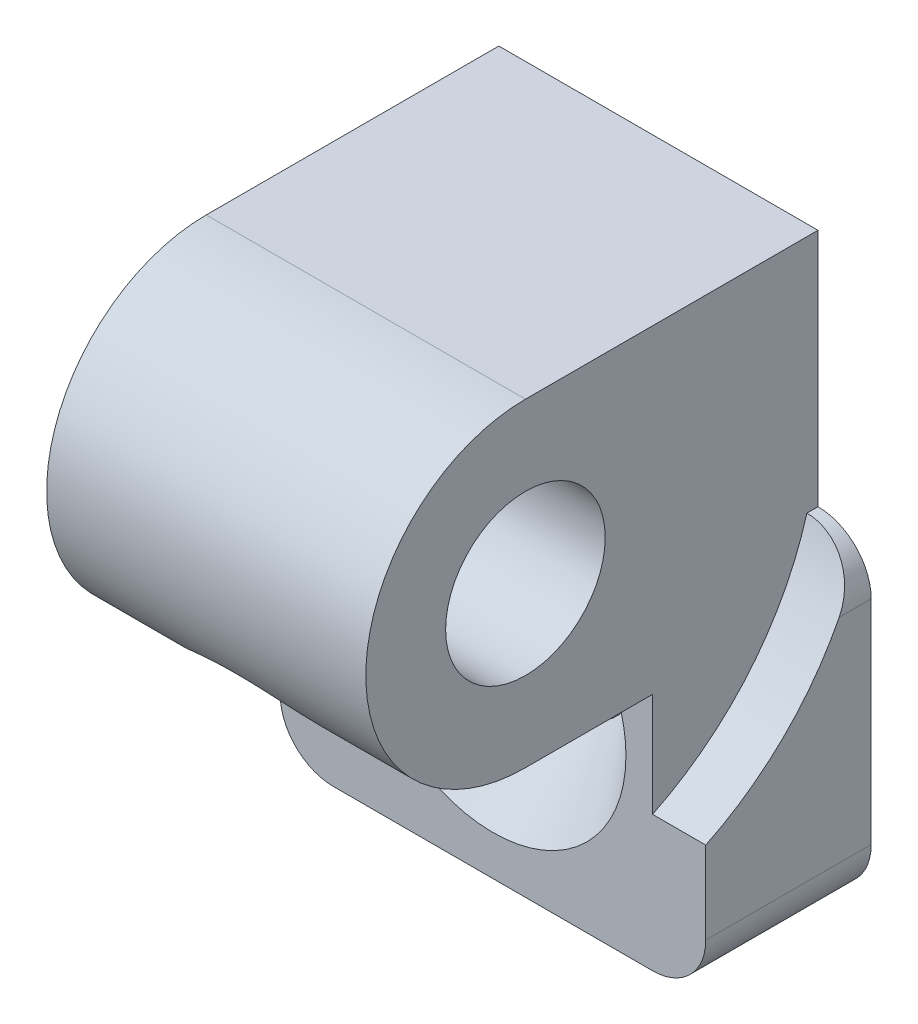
ISO-10303-21;
HEADER;
FILE_DESCRIPTION(('STEP AP214'),'2;1');
FILE_NAME('part.step','',(''),(''),'','','');
FILE_SCHEMA(('AUTOMOTIVE_DESIGN { 1 0 10303 214 1 1 1 1 }'));
ENDSEC;
DATA;
#1=APPLICATION_CONTEXT('core data for automotive mechanical design processes');
#2=APPLICATION_PROTOCOL_DEFINITION('international standard','automotive_design',2000,#1);
#3=PRODUCT_CONTEXT('',#1,'mechanical');
#4=PRODUCT('Part','Part','',(#3));
#5=PRODUCT_RELATED_PRODUCT_CATEGORY('part','',(#4));
#6=PRODUCT_DEFINITION_FORMATION('','',#4);
#7=PRODUCT_DEFINITION_CONTEXT('part definition',#1,'design');
#8=PRODUCT_DEFINITION('design','',#6,#7);
#9=PRODUCT_DEFINITION_SHAPE('','',#8);
#10=(LENGTH_UNIT() NAMED_UNIT(*) SI_UNIT(.MILLI.,.METRE.));
#11=(NAMED_UNIT(*) PLANE_ANGLE_UNIT() SI_UNIT($,.RADIAN.));
#12=(NAMED_UNIT(*) SI_UNIT($,.STERADIAN.) SOLID_ANGLE_UNIT());
#13=UNCERTAINTY_MEASURE_WITH_UNIT(LENGTH_MEASURE(1.E-05),#10,'distance_accuracy_value','');
#14=(GEOMETRIC_REPRESENTATION_CONTEXT(3) GLOBAL_UNCERTAINTY_ASSIGNED_CONTEXT((#13)) GLOBAL_UNIT_ASSIGNED_CONTEXT((#10,
#11,#12)) REPRESENTATION_CONTEXT('',''));
#15=CARTESIAN_POINT('',(0.,0.,0.));
#16=DIRECTION('',(0.,0.,1.));
#17=DIRECTION('',(1.,0.,0.));
#18=AXIS2_PLACEMENT_3D('',#15,#16,#17);
#19=CARTESIAN_POINT('',(8.,8.5,11.));
#20=DIRECTION('',(-1.,0.,0.));
#21=DIRECTION('',(0.,1.,0.));
#22=AXIS2_PLACEMENT_3D('',#19,#20,#21);
#23=CYLINDRICAL_SURFACE('',#22,6.);
#24=DIRECTION('',(-1.,0.,0.));
#25=VECTOR('',#24,1.);
#26=CARTESIAN_POINT('',(8.,2.5,11.));
#27=LINE('',#26,#25);
#28=CARTESIAN_POINT('',(-4.3301270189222,2.5,11.));
#29=VERTEX_POINT('',#28);
#30=CARTESIAN_POINT('',(-6.,2.5,11.));
#31=VERTEX_POINT('',#30);
#32=EDGE_CURVE('E166',#29,#31,#27,.T.);
#33=ORIENTED_EDGE('',*,*,#32,.F.);
#34=CARTESIAN_POINT('',(-4.33012701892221,2.5,11.));
#35=CARTESIAN_POINT('',(-4.33009172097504,2.49997905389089,11.139691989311));
#36=CARTESIAN_POINT('',(-4.32730918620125,2.50487768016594,11.2793895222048));
#37=CARTESIAN_POINT('',(-4.31599324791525,2.52436909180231,11.5579079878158));
#38=CARTESIAN_POINT('',(-4.3074583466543,2.53896440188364,11.6967286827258));
#39=CARTESIAN_POINT('',(-4.28432707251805,2.57779463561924,11.9731769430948));
#40=CARTESIAN_POINT('',(-4.2697025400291,2.60207431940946,12.1107958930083));
#41=CARTESIAN_POINT('',(-4.23389010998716,2.65995115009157,12.383187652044));
#42=CARTESIAN_POINT('',(-4.21270267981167,2.6935476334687,12.5179606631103));
#43=CARTESIAN_POINT('',(-4.1630406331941,2.76968620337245,12.7840124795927));
#44=CARTESIAN_POINT('',(-4.13454579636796,2.81225305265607,12.9152804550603));
#45=CARTESIAN_POINT('',(-4.06950695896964,2.90557156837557,13.172814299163));
#46=CARTESIAN_POINT('',(-4.03296392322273,2.95632225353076,13.2990807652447));
#47=CARTESIAN_POINT('',(-3.95105221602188,3.06493063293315,13.5452057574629));
#48=CARTESIAN_POINT('',(-3.90570301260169,3.1227725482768,13.6650776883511));
#49=CARTESIAN_POINT('',(-3.80528553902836,3.24438188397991,13.8975291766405));
#50=CARTESIAN_POINT('',(-3.75021851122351,3.3081485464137,14.0101096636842));
#51=CARTESIAN_POINT('',(-3.63430725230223,3.4349091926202,14.2184720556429));
#52=CARTESIAN_POINT('',(-3.5742376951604,3.49758248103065,14.3148798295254));
#53=CARTESIAN_POINT('',(-3.44482894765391,3.62510686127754,14.4997173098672));
#54=CARTESIAN_POINT('',(-3.37549019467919,3.68995785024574,14.5881473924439));
#55=CARTESIAN_POINT('',(-3.22745139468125,3.82011288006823,14.7563228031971));
#56=CARTESIAN_POINT('',(-3.14875629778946,3.88541666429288,14.8360726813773));
#57=CARTESIAN_POINT('',(-2.98214565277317,4.01471252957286,14.986481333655));
#58=CARTESIAN_POINT('',(-2.89423124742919,4.07870477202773,15.05714123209));
#59=CARTESIAN_POINT('',(-2.72181660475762,4.19536434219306,15.1804719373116));
#60=CARTESIAN_POINT('',(-2.63838908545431,4.24841392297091,15.234286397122));
#61=CARTESIAN_POINT('',(-2.46542153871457,4.35106961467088,15.334921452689));
#62=CARTESIAN_POINT('',(-2.37588176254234,4.40067586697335,15.3817423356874));
#63=CARTESIAN_POINT('',(-2.19128755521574,4.49544488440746,15.4685198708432));
#64=CARTESIAN_POINT('',(-2.09623269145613,4.54060730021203,15.5084759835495));
#65=CARTESIAN_POINT('',(-1.90130558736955,4.62561807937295,15.5817371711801));
#66=CARTESIAN_POINT('',(-1.80143328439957,4.66546637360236,15.6150421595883));
#67=CARTESIAN_POINT('',(-1.60102602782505,4.73789916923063,15.6742606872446));
#68=CARTESIAN_POINT('',(-1.50062425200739,4.77068159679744,15.7003836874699));
#69=CARTESIAN_POINT('',(-1.29669092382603,4.83010106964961,15.7469218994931));
#70=CARTESIAN_POINT('',(-1.19315835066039,4.85673608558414,15.7673352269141));
#71=CARTESIAN_POINT('',(-0.983735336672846,4.90344495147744,15.802671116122));
#72=CARTESIAN_POINT('',(-0.877845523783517,4.92352052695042,15.8175951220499));
#73=CARTESIAN_POINT('',(-0.664354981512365,4.95684472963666,15.8421564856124));
#74=CARTESIAN_POINT('',(-0.556753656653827,4.97009092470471,15.8517919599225));
#75=CARTESIAN_POINT('',(-0.337043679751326,4.98988592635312,15.8661334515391));
#76=CARTESIAN_POINT('',(-0.224902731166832,4.99620145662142,15.8706678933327));
#77=CARTESIAN_POINT('',(-0.000361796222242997,5.00126101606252,15.8743035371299));
#78=CARTESIAN_POINT('',(0.112038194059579,5.00000492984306,15.873404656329));
#79=CARTESIAN_POINT('',(0.336362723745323,4.98993684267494,15.8661581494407));
#80=CARTESIAN_POINT('',(0.448287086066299,4.98112223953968,15.8598086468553));
#81=CARTESIAN_POINT('',(0.670804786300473,4.95606213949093,15.8415642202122));
#82=CARTESIAN_POINT('',(0.781398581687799,4.93981927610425,15.8296712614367));
#83=CARTESIAN_POINT('',(1.00218354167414,4.89983710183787,15.7999434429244));
#84=CARTESIAN_POINT('',(1.11234300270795,4.87598753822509,15.7820209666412));
#85=CARTESIAN_POINT('',(1.32966580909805,4.82125913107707,15.7400478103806));
#86=CARTESIAN_POINT('',(1.43683025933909,4.79038291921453,15.7159994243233));
#87=CARTESIAN_POINT('',(1.6473765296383,4.72211772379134,15.6614924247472));
#88=CARTESIAN_POINT('',(1.75075880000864,4.68472951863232,15.6310345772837));
#89=CARTESIAN_POINT('',(1.95295291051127,4.60410892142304,15.5634195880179));
#90=CARTESIAN_POINT('',(2.05176490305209,4.5608767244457,15.5262626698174));
#91=CARTESIAN_POINT('',(2.24169636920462,4.47052389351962,15.4459960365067));
#92=CARTESIAN_POINT('',(2.33294534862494,4.42352521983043,15.4030554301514));
#93=CARTESIAN_POINT('',(2.5097805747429,4.32564649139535,15.3103728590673));
#94=CARTESIAN_POINT('',(2.59536488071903,4.27476511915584,15.2606285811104));
#95=CARTESIAN_POINT('',(2.76025463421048,4.1701943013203,15.1543153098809));
#96=CARTESIAN_POINT('',(2.83956409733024,4.11650668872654,15.0977507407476));
#97=CARTESIAN_POINT('',(2.99160233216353,4.0073777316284,14.9778032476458));
#98=CARTESIAN_POINT('',(3.06432869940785,3.95193575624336,14.9144178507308));
#99=CARTESIAN_POINT('',(3.20119180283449,3.8418603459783,14.7827124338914));
#100=CARTESIAN_POINT('',(3.26549845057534,3.78724159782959,14.7145564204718));
#101=CARTESIAN_POINT('',(3.38756516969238,3.67846295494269,14.5722268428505));
#102=CARTESIAN_POINT('',(3.44532289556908,3.62430323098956,14.4980511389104));
#103=CARTESIAN_POINT('',(3.55433430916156,3.51746118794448,14.3441116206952));
#104=CARTESIAN_POINT('',(3.60558946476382,3.46477853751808,14.2643490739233));
#105=CARTESIAN_POINT('',(3.70183494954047,3.36175414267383,14.0996561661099));
#106=CARTESIAN_POINT('',(3.74682296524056,3.31141326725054,14.0147239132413));
#107=CARTESIAN_POINT('',(3.83305722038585,3.21127240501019,13.835567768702));
#108=CARTESIAN_POINT('',(3.87397556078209,3.16164471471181,13.7410898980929));
#109=CARTESIAN_POINT('',(3.94961294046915,3.06663457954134,13.5475803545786));
#110=CARTESIAN_POINT('',(3.98432933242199,3.02125395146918,13.4485467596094));
#111=CARTESIAN_POINT('',(4.04802584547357,2.93536172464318,13.246521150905));
#112=CARTESIAN_POINT('',(4.07700212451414,2.89485339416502,13.1435265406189));
#113=CARTESIAN_POINT('',(4.12965172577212,2.81923731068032,12.9342487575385));
#114=CARTESIAN_POINT('',(4.15332452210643,2.78413009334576,12.8279652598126));
#115=CARTESIAN_POINT('',(4.19856277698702,2.71550669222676,12.5986744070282));
#116=CARTESIAN_POINT('',(4.21945174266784,2.68279385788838,12.4752924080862));
#117=CARTESIAN_POINT('',(4.25554070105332,2.62517214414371,12.2258815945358));
#118=CARTESIAN_POINT('',(4.27073946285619,2.60026495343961,12.0998522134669));
#119=CARTESIAN_POINT('',(4.29584642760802,2.55857272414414,11.8461372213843));
#120=CARTESIAN_POINT('',(4.3057623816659,2.54177578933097,11.7184543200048));
#121=CARTESIAN_POINT('',(4.32062458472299,2.51643020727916,11.4620354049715));
#122=CARTESIAN_POINT('',(4.32557341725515,2.50787727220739,11.3332999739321));
#123=CARTESIAN_POINT('',(4.32878579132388,2.50232157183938,11.1703450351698));
#124=CARTESIAN_POINT('',(4.3292891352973,2.50145064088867,11.1362669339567));
#125=CARTESIAN_POINT('',(4.32995960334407,2.50029018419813,11.0681267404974));
#126=CARTESIAN_POINT('',(4.33012701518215,2.50000016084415,11.0340646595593));
#127=CARTESIAN_POINT('',(4.3301270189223,2.5,11.));
#128=B_SPLINE_CURVE_WITH_KNOTS('',3,(#34,#35,#36,#37,#38,#39,#40,#41,#42,#43,#44,#45,#46,#47,
#48,#49,#50,#51,#52,#53,#54,#55,#56,#57,#58,#59,#60,#61,#62,#63,#64,#65,#66,#67,#68,#69,#70,#71,
#72,#73,#74,#75,#76,#77,#78,#79,#80,#81,#82,#83,#84,#85,#86,#87,#88,#89,#90,#91,#92,#93,#94,#95,
#96,#97,#98,#99,#100,#101,#102,#103,#104,#105,#106,#107,#108,#109,#110,#111,#112,#113,#114,#115,
#116,#117,#118,#119,#120,#121,#122,#123,#124,#125,#126,#127),.UNSPECIFIED.,.F.,.F.,(4,2,2,2,2,2,
2,2,2,2,2,2,2,2,2,2,2,2,2,2,2,2,2,2,2,2,2,2,2,2,2,2,2,2,2,2,2,2,2,2,2,2,2,2,2,2,4),(0.,
0.418971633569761,0.838052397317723,1.2590929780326,1.68010358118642,2.10229197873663,
2.52442979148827,2.94564478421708,3.36680596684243,3.75543925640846,4.14405421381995,
4.53246447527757,4.92082664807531,5.25809076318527,5.595341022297,5.93261777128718,
6.26989890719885,6.59593180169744,6.92207217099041,7.2481266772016,7.57429722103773,
7.9111381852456,8.24798428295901,8.58494639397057,8.92178913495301,9.26375474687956,
9.60559249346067,9.9473894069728,10.2891749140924,10.622544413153,10.9560275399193,
11.2892954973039,11.622684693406,11.9476970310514,12.272825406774,12.5978802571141,
12.9230547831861,13.2655861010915,13.6082632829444,13.9511690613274,14.2941088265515,
14.6817331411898,15.0694412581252,15.4565789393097,15.8435151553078,15.9457899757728,
16.0479771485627),.UNSPECIFIED.);
#129=CARTESIAN_POINT('',(4.33012701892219,2.5,11.));
#130=VERTEX_POINT('',#129);
#131=EDGE_CURVE('E160',#29,#130,#128,.T.);
#132=ORIENTED_EDGE('',*,*,#131,.T.);
#133=CARTESIAN_POINT('',(6.,2.5,11.));
#134=VERTEX_POINT('',#133);
#135=EDGE_CURVE('E154',#134,#130,#27,.T.);
#136=ORIENTED_EDGE('',*,*,#135,.F.);
#137=CARTESIAN_POINT('',(6.,8.5,11.));
#138=DIRECTION('',(-1.,0.,0.));
#139=DIRECTION('',(0.,1.,0.));
#140=AXIS2_PLACEMENT_3D('',#137,#138,#139);
#141=CIRCLE('',#140,6.);
#142=CARTESIAN_POINT('',(6.,14.5,11.));
#143=VERTEX_POINT('',#142);
#144=EDGE_CURVE('E308',#134,#143,#141,.T.);
#145=ORIENTED_EDGE('',*,*,#144,.T.);
#146=DIRECTION('',(-1.,0.,0.));
#147=VECTOR('',#146,1.);
#148=CARTESIAN_POINT('',(8.,14.5,11.));
#149=LINE('',#148,#147);
#150=CARTESIAN_POINT('',(-6.,14.5,11.));
#151=VERTEX_POINT('',#150);
#152=EDGE_CURVE('E174',#143,#151,#149,.T.);
#153=ORIENTED_EDGE('',*,*,#152,.T.);
#154=CARTESIAN_POINT('',(-6.,8.5,11.));
#155=DIRECTION('',(-1.,0.,0.));
#156=DIRECTION('',(0.,1.,0.));
#157=AXIS2_PLACEMENT_3D('',#154,#155,#156);
#158=CIRCLE('',#157,6.);
#159=EDGE_CURVE('E321',#31,#151,#158,.T.);
#160=ORIENTED_EDGE('',*,*,#159,.F.);
#161=EDGE_LOOP('',(#33,#132,#136,#145,#153,#160));
#162=FACE_BOUND('',#161,.T.);
#163=ADVANCED_FACE('F14',(#162),#23,.T.);
#164=CARTESIAN_POINT('',(8.,2.5,6.22));
#165=DIRECTION('',(0.,-1.,0.));
#166=DIRECTION('',(0.,0.,1.));
#167=AXIS2_PLACEMENT_3D('',#164,#165,#166);
#168=PLANE('',#167);
#169=DIRECTION('',(-1.,0.,0.));
#170=VECTOR('',#169,1.);
#171=CARTESIAN_POINT('',(8.,2.5,6.22));
#172=LINE('',#171,#170);
#173=CARTESIAN_POINT('',(-4.3301270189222,2.5,6.22));
#174=VERTEX_POINT('',#173);
#175=CARTESIAN_POINT('',(-6.,2.5,6.22));
#176=VERTEX_POINT('',#175);
#177=EDGE_CURVE('E167',#174,#176,#172,.T.);
#178=ORIENTED_EDGE('',*,*,#177,.F.);
#179=DIRECTION('',(0.,0.,-1.));
#180=VECTOR('',#179,1.);
#181=CARTESIAN_POINT('',(-4.3301270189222,2.50000000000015,48.22));
#182=LINE('',#181,#180);
#183=EDGE_CURVE('E139',#29,#174,#182,.T.);
#184=ORIENTED_EDGE('',*,*,#183,.F.);
#185=ORIENTED_EDGE('',*,*,#32,.T.);
#186=DIRECTION('',(0.,0.,1.));
#187=VECTOR('',#186,1.);
#188=CARTESIAN_POINT('',(-6.,2.5,6.22));
#189=LINE('',#188,#187);
#190=EDGE_CURVE('E318',#176,#31,#189,.T.);
#191=ORIENTED_EDGE('',*,*,#190,.F.);
#192=EDGE_LOOP('',(#178,#184,#185,#191));
#193=FACE_BOUND('',#192,.T.);
#194=ADVANCED_FACE('F251',(#193),#168,.T.);
#195=ORIENTED_EDGE('',*,*,#135,.T.);
#196=DIRECTION('',(0.,0.,-1.));
#197=VECTOR('',#196,1.);
#198=CARTESIAN_POINT('',(4.33012701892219,2.50000000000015,48.22));
#199=LINE('',#198,#197);
#200=CARTESIAN_POINT('',(4.33012701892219,2.5,6.22));
#201=VERTEX_POINT('',#200);
#202=EDGE_CURVE('E136',#130,#201,#199,.T.);
#203=ORIENTED_EDGE('',*,*,#202,.T.);
#204=CARTESIAN_POINT('',(6.,2.5,6.22));
#205=VERTEX_POINT('',#204);
#206=EDGE_CURVE('E152',#205,#201,#172,.T.);
#207=ORIENTED_EDGE('',*,*,#206,.F.);
#208=DIRECTION('',(0.,0.,1.));
#209=VECTOR('',#208,1.);
#210=CARTESIAN_POINT('',(6.,2.5,6.22));
#211=LINE('',#210,#209);
#212=EDGE_CURVE('E294',#205,#134,#211,.T.);
#213=ORIENTED_EDGE('',*,*,#212,.T.);
#214=EDGE_LOOP('',(#195,#203,#207,#213));
#215=FACE_BOUND('',#214,.T.);
#216=ADVANCED_FACE('F149',(#215),#168,.T.);
#217=CARTESIAN_POINT('',(8.,-6.5,6.22));
#218=DIRECTION('',(0.,0.,1.));
#219=DIRECTION('',(0.,1.,0.));
#220=AXIS2_PLACEMENT_3D('',#217,#218,#219);
#221=PLANE('',#220);
#222=DIRECTION('',(0.,1.,0.));
#223=VECTOR('',#222,1.);
#224=CARTESIAN_POINT('',(-8.,-6.5,6.22));
#225=LINE('',#224,#223);
#226=CARTESIAN_POINT('',(-8.,-4.5,6.22));
#227=VERTEX_POINT('',#226);
#228=CARTESIAN_POINT('',(-8.,-1.40714893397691,6.22));
#229=VERTEX_POINT('',#228);
#230=EDGE_CURVE('E188',#227,#229,#225,.T.);
#231=ORIENTED_EDGE('',*,*,#230,.F.);
#232=CARTESIAN_POINT('',(-6.,-4.5,6.22));
#233=DIRECTION('',(0.,0.,1.));
#234=DIRECTION('',(0.,1.,0.));
#235=AXIS2_PLACEMENT_3D('',#232,#233,#234);
#236=CIRCLE('',#235,2.);
#237=CARTESIAN_POINT('',(-6.,-6.5,6.22));
#238=VERTEX_POINT('',#237);
#239=EDGE_CURVE('E200',#227,#238,#236,.T.);
#240=ORIENTED_EDGE('',*,*,#239,.T.);
#241=DIRECTION('',(-1.,0.,0.));
#242=VECTOR('',#241,1.);
#243=CARTESIAN_POINT('',(8.,-6.5,6.22));
#244=LINE('',#243,#242);
#245=CARTESIAN_POINT('',(6.,-6.5,6.22));
#246=VERTEX_POINT('',#245);
#247=EDGE_CURVE('E181',#246,#238,#244,.T.);
#248=ORIENTED_EDGE('',*,*,#247,.F.);
#249=CARTESIAN_POINT('',(6.,-4.5,6.22));
#250=DIRECTION('',(0.,0.,1.));
#251=DIRECTION('',(0.,1.,0.));
#252=AXIS2_PLACEMENT_3D('',#249,#250,#251);
#253=CIRCLE('',#252,2.);
#254=CARTESIAN_POINT('',(8.,-4.5,6.22));
#255=VERTEX_POINT('',#254);
#256=EDGE_CURVE('E198',#246,#255,#253,.T.);
#257=ORIENTED_EDGE('',*,*,#256,.T.);
#258=DIRECTION('',(0.,1.,0.));
#259=VECTOR('',#258,1.);
#260=CARTESIAN_POINT('',(8.,-6.5,6.22));
#261=LINE('',#260,#259);
#262=CARTESIAN_POINT('',(8.,-1.40714893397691,6.22));
#263=VERTEX_POINT('',#262);
#264=EDGE_CURVE('E344',#255,#263,#261,.T.);
#265=ORIENTED_EDGE('',*,*,#264,.T.);
#266=DIRECTION('',(1.,0.,0.));
#267=VECTOR('',#266,1.);
#268=CARTESIAN_POINT('',(6.,-1.40714893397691,6.22));
#269=LINE('',#268,#267);
#270=CARTESIAN_POINT('',(6.,-1.40714893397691,6.22));
#271=VERTEX_POINT('',#270);
#272=EDGE_CURVE('E291',#271,#263,#269,.T.);
#273=ORIENTED_EDGE('',*,*,#272,.F.);
#274=DIRECTION('',(0.,1.,0.));
#275=VECTOR('',#274,1.);
#276=CARTESIAN_POINT('',(6.,-1.40714893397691,6.22));
#277=LINE('',#276,#275);
#278=EDGE_CURVE('E165',#271,#205,#277,.T.);
#279=ORIENTED_EDGE('',*,*,#278,.T.);
#280=ORIENTED_EDGE('',*,*,#206,.T.);
#281=CARTESIAN_POINT('',(0.,0.,6.22));
#282=DIRECTION('',(0.,0.,1.));
#283=DIRECTION('',(1.,0.,0.));
#284=AXIS2_PLACEMENT_3D('',#281,#282,#283);
#285=CIRCLE('',#284,5.);
#286=EDGE_CURVE('E144',#174,#201,#285,.T.);
#287=ORIENTED_EDGE('',*,*,#286,.F.);
#288=ORIENTED_EDGE('',*,*,#177,.T.);
#289=DIRECTION('',(0.,1.,0.));
#290=VECTOR('',#289,1.);
#291=CARTESIAN_POINT('',(-6.,-1.40714893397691,6.22));
#292=LINE('',#291,#290);
#293=CARTESIAN_POINT('',(-6.,-1.40714893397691,6.22));
#294=VERTEX_POINT('',#293);
#295=EDGE_CURVE('E336',#294,#176,#292,.T.);
#296=ORIENTED_EDGE('',*,*,#295,.F.);
#297=DIRECTION('',(-1.,0.,0.));
#298=VECTOR('',#297,1.);
#299=CARTESIAN_POINT('',(-6.,-1.40714893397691,6.22));
#300=LINE('',#299,#298);
#301=EDGE_CURVE('E189',#294,#229,#300,.T.);
#302=ORIENTED_EDGE('',*,*,#301,.T.);
#303=EDGE_LOOP('',(#231,#240,#248,#257,#265,#273,#279,#280,#287,#288,#296,#302));
#304=FACE_BOUND('',#303,.T.);
#305=ADVANCED_FACE('F163',(#304),#221,.T.);
#306=CARTESIAN_POINT('',(8.,-6.5,0.));
#307=DIRECTION('',(0.,0.,1.));
#308=DIRECTION('',(1.,0.,0.));
#309=AXIS2_PLACEMENT_3D('',#306,#307,#308);
#310=PLANE('',#309);
#311=DIRECTION('',(-1.,0.,0.));
#312=VECTOR('',#311,1.);
#313=CARTESIAN_POINT('',(8.,-6.5,0.));
#314=LINE('',#313,#312);
#315=CARTESIAN_POINT('',(6.,-6.5,0.));
#316=VERTEX_POINT('',#315);
#317=CARTESIAN_POINT('',(-6.,-6.5,0.));
#318=VERTEX_POINT('',#317);
#319=EDGE_CURVE('E178',#316,#318,#314,.T.);
#320=ORIENTED_EDGE('',*,*,#319,.T.);
#321=CARTESIAN_POINT('',(-6.,-4.5,0.));
#322=DIRECTION('',(0.,0.,1.));
#323=DIRECTION('',(1.,0.,0.));
#324=AXIS2_PLACEMENT_3D('',#321,#322,#323);
#325=CIRCLE('',#324,2.);
#326=CARTESIAN_POINT('',(-8.,-4.5,0.));
#327=VERTEX_POINT('',#326);
#328=EDGE_CURVE('E212',#318,#327,#325,.F.);
#329=ORIENTED_EDGE('',*,*,#328,.T.);
#330=DIRECTION('',(0.,1.,0.));
#331=VECTOR('',#330,1.);
#332=CARTESIAN_POINT('',(-8.,-6.5,0.));
#333=LINE('',#332,#331);
#334=CARTESIAN_POINT('',(-8.,3.5,0.));
#335=VERTEX_POINT('',#334);
#336=EDGE_CURVE('E342',#327,#335,#333,.T.);
#337=ORIENTED_EDGE('',*,*,#336,.T.);
#338=CARTESIAN_POINT('',(-6.,3.5,0.));
#339=DIRECTION('',(0.,0.,1.));
#340=DIRECTION('',(1.,0.,0.));
#341=AXIS2_PLACEMENT_3D('',#338,#339,#340);
#342=CIRCLE('',#341,2.);
#343=CARTESIAN_POINT('',(-6.,5.5,0.));
#344=VERTEX_POINT('',#343);
#345=EDGE_CURVE('E210',#335,#344,#342,.F.);
#346=ORIENTED_EDGE('',*,*,#345,.T.);
#347=DIRECTION('',(0.,-1.,0.));
#348=VECTOR('',#347,1.);
#349=CARTESIAN_POINT('',(-6.,14.5,0.));
#350=LINE('',#349,#348);
#351=CARTESIAN_POINT('',(-6.,14.5,0.));
#352=VERTEX_POINT('',#351);
#353=EDGE_CURVE('E327',#352,#344,#350,.T.);
#354=ORIENTED_EDGE('',*,*,#353,.F.);
#355=DIRECTION('',(-1.,0.,0.));
#356=VECTOR('',#355,1.);
#357=CARTESIAN_POINT('',(8.,14.5,0.));
#358=LINE('',#357,#356);
#359=CARTESIAN_POINT('',(6.,14.5,0.));
#360=VERTEX_POINT('',#359);
#361=EDGE_CURVE('E176',#360,#352,#358,.T.);
#362=ORIENTED_EDGE('',*,*,#361,.F.);
#363=DIRECTION('',(0.,-1.,0.));
#364=VECTOR('',#363,1.);
#365=CARTESIAN_POINT('',(6.,14.5,0.));
#366=LINE('',#365,#364);
#367=CARTESIAN_POINT('',(6.,5.5,0.));
#368=VERTEX_POINT('',#367);
#369=EDGE_CURVE('E303',#360,#368,#366,.T.);
#370=ORIENTED_EDGE('',*,*,#369,.T.);
#371=CARTESIAN_POINT('',(6.,3.5,0.));
#372=DIRECTION('',(0.,0.,1.));
#373=DIRECTION('',(1.,0.,0.));
#374=AXIS2_PLACEMENT_3D('',#371,#372,#373);
#375=CIRCLE('',#374,2.);
#376=CARTESIAN_POINT('',(8.,3.5,0.));
#377=VERTEX_POINT('',#376);
#378=EDGE_CURVE('E41',#368,#377,#375,.F.);
#379=ORIENTED_EDGE('',*,*,#378,.T.);
#380=DIRECTION('',(0.,1.,0.));
#381=VECTOR('',#380,1.);
#382=CARTESIAN_POINT('',(8.,-6.5,0.));
#383=LINE('',#382,#381);
#384=CARTESIAN_POINT('',(8.,-4.5,0.));
#385=VERTEX_POINT('',#384);
#386=EDGE_CURVE('E170',#385,#377,#383,.T.);
#387=ORIENTED_EDGE('',*,*,#386,.F.);
#388=CARTESIAN_POINT('',(6.,-4.5,0.));
#389=DIRECTION('',(0.,0.,1.));
#390=DIRECTION('',(1.,0.,0.));
#391=AXIS2_PLACEMENT_3D('',#388,#389,#390);
#392=CIRCLE('',#391,2.);
#393=EDGE_CURVE('E208',#385,#316,#392,.F.);
#394=ORIENTED_EDGE('',*,*,#393,.T.);
#395=EDGE_LOOP('',(#320,#329,#337,#346,#354,#362,#370,#379,#387,#394));
#396=FACE_BOUND('',#395,.T.);
#397=CARTESIAN_POINT('',(0.,0.,0.));
#398=DIRECTION('',(0.,0.,1.));
#399=DIRECTION('',(1.,0.,0.));
#400=AXIS2_PLACEMENT_3D('',#397,#398,#399);
#401=CIRCLE('',#400,2.5);
#402=CARTESIAN_POINT('',(2.5,0.,0.));
#403=VERTEX_POINT('',#402);
#404=EDGE_CURVE('E190',#403,#403,#401,.F.);
#405=ORIENTED_EDGE('',*,*,#404,.F.);
#406=EDGE_LOOP('',(#405));
#407=FACE_BOUND('',#406,.T.);
#408=ADVANCED_FACE('F250',(#396,#407),#310,.F.);
#409=CARTESIAN_POINT('',(8.,14.5,0.));
#410=DIRECTION('',(0.,-1.,0.));
#411=DIRECTION('',(0.,0.,1.));
#412=AXIS2_PLACEMENT_3D('',#409,#410,#411);
#413=PLANE('',#412);
#414=DIRECTION('',(0.,0.,-1.));
#415=VECTOR('',#414,1.);
#416=CARTESIAN_POINT('',(6.,14.5,11.));
#417=LINE('',#416,#415);
#418=EDGE_CURVE('E305',#143,#360,#417,.T.);
#419=ORIENTED_EDGE('',*,*,#418,.T.);
#420=ORIENTED_EDGE('',*,*,#361,.T.);
#421=DIRECTION('',(0.,0.,-1.));
#422=VECTOR('',#421,1.);
#423=CARTESIAN_POINT('',(-6.,14.5,11.));
#424=LINE('',#423,#422);
#425=EDGE_CURVE('E324',#151,#352,#424,.T.);
#426=ORIENTED_EDGE('',*,*,#425,.F.);
#427=ORIENTED_EDGE('',*,*,#152,.F.);
#428=EDGE_LOOP('',(#419,#420,#426,#427));
#429=FACE_BOUND('',#428,.T.);
#430=ADVANCED_FACE('F239',(#429),#413,.F.);
#431=CARTESIAN_POINT('',(8.,8.5,11.));
#432=DIRECTION('',(-1.,0.,0.));
#433=DIRECTION('',(0.,1.,0.));
#434=AXIS2_PLACEMENT_3D('',#431,#432,#433);
#435=CYLINDRICAL_SURFACE('',#434,3.);
#436=CARTESIAN_POINT('',(-6.,8.5,11.));
#437=DIRECTION('',(-1.,0.,0.));
#438=DIRECTION('',(0.,1.,0.));
#439=AXIS2_PLACEMENT_3D('',#436,#437,#438);
#440=CIRCLE('',#439,3.);
#441=CARTESIAN_POINT('',(-6.,11.5,11.));
#442=VERTEX_POINT('',#441);
#443=EDGE_CURVE('E185',#442,#442,#440,.F.);
#444=ORIENTED_EDGE('',*,*,#443,.F.);
#445=EDGE_LOOP('',(#444));
#446=FACE_BOUND('',#445,.T.);
#447=CARTESIAN_POINT('',(6.,8.5,11.));
#448=DIRECTION('',(1.,0.,0.));
#449=DIRECTION('',(0.,-1.,0.));
#450=AXIS2_PLACEMENT_3D('',#447,#448,#449);
#451=CIRCLE('',#450,3.);
#452=CARTESIAN_POINT('',(6.,5.5,11.));
#453=VERTEX_POINT('',#452);
#454=EDGE_CURVE('E312',#453,#453,#451,.F.);
#455=ORIENTED_EDGE('',*,*,#454,.F.);
#456=EDGE_LOOP('',(#455));
#457=FACE_BOUND('',#456,.T.);
#458=ADVANCED_FACE('F235',(#446,#457),#435,.F.);
#459=CARTESIAN_POINT('',(8.,8.5,11.));
#460=DIRECTION('',(-1.,0.,0.));
#461=DIRECTION('',(0.,1.,0.));
#462=AXIS2_PLACEMENT_3D('',#459,#460,#461);
#463=PLANE('',#462);
#464=ORIENTED_EDGE('',*,*,#264,.F.);
#465=DIRECTION('',(0.,0.,1.));
#466=VECTOR('',#465,1.);
#467=CARTESIAN_POINT('',(8.,-4.5,0.));
#468=LINE('',#467,#466);
#469=EDGE_CURVE('E28',#255,#385,#468,.F.);
#470=ORIENTED_EDGE('',*,*,#469,.T.);
#471=ORIENTED_EDGE('',*,*,#386,.T.);
#472=DIRECTION('',(0.,0.,1.));
#473=VECTOR('',#472,1.);
#474=CARTESIAN_POINT('',(8.,3.5,11.));
#475=LINE('',#474,#473);
#476=CARTESIAN_POINT('',(8.,3.5,1.20204102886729));
#477=VERTEX_POINT('',#476);
#478=EDGE_CURVE('E222',#377,#477,#475,.T.);
#479=ORIENTED_EDGE('',*,*,#478,.T.);
#480=CARTESIAN_POINT('',(8.,8.5,11.));
#481=DIRECTION('',(-1.,0.,0.));
#482=DIRECTION('',(0.,1.,0.));
#483=AXIS2_PLACEMENT_3D('',#480,#481,#482);
#484=CIRCLE('',#483,11.);
#485=EDGE_CURVE('E193',#477,#263,#484,.T.);
#486=ORIENTED_EDGE('',*,*,#485,.T.);
#487=EDGE_LOOP('',(#464,#470,#471,#479,#486));
#488=FACE_BOUND('',#487,.T.);
#489=ADVANCED_FACE('F238',(#488),#463,.F.);
#490=CARTESIAN_POINT('',(8.,-6.5,0.));
#491=DIRECTION('',(0.,-1.,0.));
#492=DIRECTION('',(-1.,0.,0.));
#493=AXIS2_PLACEMENT_3D('',#490,#491,#492);
#494=PLANE('',#493);
#495=ORIENTED_EDGE('',*,*,#247,.T.);
#496=DIRECTION('',(0.,0.,1.));
#497=VECTOR('',#496,1.);
#498=CARTESIAN_POINT('',(-6.,-6.5,0.));
#499=LINE('',#498,#497);
#500=EDGE_CURVE('E205',#238,#318,#499,.F.);
#501=ORIENTED_EDGE('',*,*,#500,.T.);
#502=ORIENTED_EDGE('',*,*,#319,.F.);
#503=DIRECTION('',(0.,0.,1.));
#504=VECTOR('',#503,1.);
#505=CARTESIAN_POINT('',(6.,-6.5,0.));
#506=LINE('',#505,#504);
#507=EDGE_CURVE('E202',#316,#246,#506,.T.);
#508=ORIENTED_EDGE('',*,*,#507,.T.);
#509=EDGE_LOOP('',(#495,#501,#502,#508));
#510=FACE_BOUND('',#509,.T.);
#511=ADVANCED_FACE('F16',(#510),#494,.T.);
#512=CARTESIAN_POINT('',(-8.,8.5,11.));
#513=DIRECTION('',(-1.,0.,0.));
#514=DIRECTION('',(0.,1.,0.));
#515=AXIS2_PLACEMENT_3D('',#512,#513,#514);
#516=PLANE('',#515);
#517=ORIENTED_EDGE('',*,*,#336,.F.);
#518=DIRECTION('',(0.,0.,1.));
#519=VECTOR('',#518,1.);
#520=CARTESIAN_POINT('',(-8.,-4.5,11.));
#521=LINE('',#520,#519);
#522=EDGE_CURVE('E195',#327,#227,#521,.T.);
#523=ORIENTED_EDGE('',*,*,#522,.T.);
#524=ORIENTED_EDGE('',*,*,#230,.T.);
#525=CARTESIAN_POINT('',(-8.,8.5,11.));
#526=DIRECTION('',(-1.,0.,0.));
#527=DIRECTION('',(0.,1.,0.));
#528=AXIS2_PLACEMENT_3D('',#525,#526,#527);
#529=CIRCLE('',#528,11.);
#530=CARTESIAN_POINT('',(-8.,3.5,1.20204102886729));
#531=VERTEX_POINT('',#530);
#532=EDGE_CURVE('E315',#531,#229,#529,.T.);
#533=ORIENTED_EDGE('',*,*,#532,.F.);
#534=DIRECTION('',(0.,0.,1.));
#535=VECTOR('',#534,1.);
#536=CARTESIAN_POINT('',(-8.,3.5,0.));
#537=LINE('',#536,#535);
#538=EDGE_CURVE('E184',#531,#335,#537,.F.);
#539=ORIENTED_EDGE('',*,*,#538,.T.);
#540=EDGE_LOOP('',(#517,#523,#524,#533,#539));
#541=FACE_BOUND('',#540,.T.);
#542=ADVANCED_FACE('F241',(#541),#516,.T.);
#543=CARTESIAN_POINT('',(-6.,8.5,11.));
#544=DIRECTION('',(-1.,0.,0.));
#545=DIRECTION('',(0.,1.,0.));
#546=AXIS2_PLACEMENT_3D('',#543,#544,#545);
#547=PLANE('',#546);
#548=ORIENTED_EDGE('',*,*,#190,.T.);
#549=ORIENTED_EDGE('',*,*,#159,.T.);
#550=ORIENTED_EDGE('',*,*,#425,.T.);
#551=ORIENTED_EDGE('',*,*,#353,.T.);
#552=DIRECTION('',(0.,0.,1.));
#553=VECTOR('',#552,1.);
#554=CARTESIAN_POINT('',(-6.,5.5,0.));
#555=LINE('',#554,#553);
#556=CARTESIAN_POINT('',(-6.,5.5,0.41699475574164));
#557=VERTEX_POINT('',#556);
#558=EDGE_CURVE('E330',#344,#557,#555,.T.);
#559=ORIENTED_EDGE('',*,*,#558,.T.);
#560=CARTESIAN_POINT('',(-6.,8.5,11.));
#561=DIRECTION('',(-1.,0.,0.));
#562=DIRECTION('',(0.,1.,0.));
#563=AXIS2_PLACEMENT_3D('',#560,#561,#562);
#564=CIRCLE('',#563,11.);
#565=EDGE_CURVE('E333',#557,#294,#564,.T.);
#566=ORIENTED_EDGE('',*,*,#565,.T.);
#567=ORIENTED_EDGE('',*,*,#295,.T.);
#568=EDGE_LOOP('',(#548,#549,#550,#551,#559,#566,#567));
#569=FACE_BOUND('',#568,.T.);
#570=ORIENTED_EDGE('',*,*,#443,.T.);
#571=EDGE_LOOP('',(#570));
#572=FACE_BOUND('',#571,.T.);
#573=ADVANCED_FACE('F233',(#569,#572),#547,.T.);
#574=CARTESIAN_POINT('',(-6.,8.5,11.));
#575=DIRECTION('',(-1.,0.,0.));
#576=DIRECTION('',(0.,1.,0.));
#577=AXIS2_PLACEMENT_3D('',#574,#575,#576);
#578=CYLINDRICAL_SURFACE('',#577,11.);
#579=ORIENTED_EDGE('',*,*,#565,.F.);
#580=CARTESIAN_POINT('',(-6.,5.5,0.41699475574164));
#581=CARTESIAN_POINT('',(-6.05439595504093,5.50000061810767,0.416997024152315));
#582=CARTESIAN_POINT('',(-6.10876564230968,5.49777929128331,0.417623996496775));
#583=CARTESIAN_POINT('',(-6.21711088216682,5.48892417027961,0.420139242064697));
#584=CARTESIAN_POINT('',(-6.27108646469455,5.48229071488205,0.422027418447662));
#585=CARTESIAN_POINT('',(-6.43168323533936,5.45585811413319,0.429590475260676));
#586=CARTESIAN_POINT('',(-6.53721998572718,5.42952641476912,0.437163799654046));
#587=CARTESIAN_POINT('',(-6.74217730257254,5.36034727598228,0.457520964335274));
#588=CARTESIAN_POINT('',(-6.84159571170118,5.31749404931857,0.470306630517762));
#589=CARTESIAN_POINT('',(-7.03160111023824,5.21678574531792,0.501273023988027));
#590=CARTESIAN_POINT('',(-7.1221884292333,5.15893122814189,0.51945354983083));
#591=CARTESIAN_POINT('',(-7.2928460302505,5.02973766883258,0.561517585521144));
#592=CARTESIAN_POINT('',(-7.37282589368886,4.95829394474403,0.585445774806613));
#593=CARTESIAN_POINT('',(-7.51951958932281,4.80473656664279,0.638936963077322));
#594=CARTESIAN_POINT('',(-7.58623369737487,4.72262313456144,0.668499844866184));
#595=CARTESIAN_POINT('',(-7.70704437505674,4.54769200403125,0.734122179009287));
#596=CARTESIAN_POINT('',(-7.76066914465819,4.4546159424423,0.770359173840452));
#597=CARTESIAN_POINT('',(-7.85181450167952,4.26292938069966,0.848253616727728));
#598=CARTESIAN_POINT('',(-7.88932057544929,4.16431398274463,0.889915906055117));
#599=CARTESIAN_POINT('',(-7.94612853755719,3.97119419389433,0.97501902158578));
#600=CARTESIAN_POINT('',(-7.96648419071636,3.87685874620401,1.01815229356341));
#601=CARTESIAN_POINT('',(-7.99341946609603,3.68808632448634,1.10775055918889));
#602=CARTESIAN_POINT('',(-8.00003368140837,3.59365020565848,1.15420688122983));
#603=CARTESIAN_POINT('',(-8.,3.5,1.20204102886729));
#604=B_SPLINE_CURVE_WITH_KNOTS('',3,(#580,#581,#582,#583,#584,#585,#586,#587,#588,#589,#590,
#591,#592,#593,#594,#595,#596,#597,#598,#599,#600,#601,#602,#603),.UNSPECIFIED.,.F.,.F.,(4,2,2,
2,2,2,2,2,2,2,2,4),(0.,0.163086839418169,0.326161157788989,0.651582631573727,0.97711819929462,
1.30264161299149,1.63078239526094,1.95891635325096,2.29754522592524,2.63647837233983,
2.95263997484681,3.26800469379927),.UNSPECIFIED.);
#605=EDGE_CURVE('E214',#557,#531,#604,.T.);
#606=ORIENTED_EDGE('',*,*,#605,.T.);
#607=ORIENTED_EDGE('',*,*,#532,.T.);
#608=ORIENTED_EDGE('',*,*,#301,.F.);
#609=EDGE_LOOP('',(#579,#606,#607,#608));
#610=FACE_BOUND('',#609,.T.);
#611=ADVANCED_FACE('F227',(#610),#578,.F.);
#612=CARTESIAN_POINT('',(6.,8.5,11.));
#613=DIRECTION('',(1.,0.,0.));
#614=DIRECTION('',(0.,1.,0.));
#615=AXIS2_PLACEMENT_3D('',#612,#613,#614);
#616=PLANE('',#615);
#617=ORIENTED_EDGE('',*,*,#212,.F.);
#618=ORIENTED_EDGE('',*,*,#278,.F.);
#619=CARTESIAN_POINT('',(6.,8.5,11.));
#620=DIRECTION('',(-1.,0.,0.));
#621=DIRECTION('',(0.,1.,0.));
#622=AXIS2_PLACEMENT_3D('',#619,#620,#621);
#623=CIRCLE('',#622,11.);
#624=CARTESIAN_POINT('',(6.,5.5,0.41699475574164));
#625=VERTEX_POINT('',#624);
#626=EDGE_CURVE('E299',#625,#271,#623,.T.);
#627=ORIENTED_EDGE('',*,*,#626,.F.);
#628=DIRECTION('',(0.,0.,1.));
#629=VECTOR('',#628,1.);
#630=CARTESIAN_POINT('',(6.,5.5,0.));
#631=LINE('',#630,#629);
#632=EDGE_CURVE('E301',#368,#625,#631,.T.);
#633=ORIENTED_EDGE('',*,*,#632,.F.);
#634=ORIENTED_EDGE('',*,*,#369,.F.);
#635=ORIENTED_EDGE('',*,*,#418,.F.);
#636=ORIENTED_EDGE('',*,*,#144,.F.);
#637=EDGE_LOOP('',(#617,#618,#627,#633,#634,#635,#636));
#638=FACE_BOUND('',#637,.T.);
#639=ORIENTED_EDGE('',*,*,#454,.T.);
#640=EDGE_LOOP('',(#639));
#641=FACE_BOUND('',#640,.T.);
#642=ADVANCED_FACE('F232',(#638,#641),#616,.T.);
#643=CARTESIAN_POINT('',(6.,8.5,11.));
#644=DIRECTION('',(1.,0.,0.));
#645=DIRECTION('',(0.,-1.,0.));
#646=AXIS2_PLACEMENT_3D('',#643,#644,#645);
#647=CYLINDRICAL_SURFACE('',#646,11.);
#648=ORIENTED_EDGE('',*,*,#485,.F.);
#649=CARTESIAN_POINT('',(8.,3.5,1.20204102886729));
#650=CARTESIAN_POINT('',(7.99999657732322,3.5571200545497,1.1728892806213));
#651=CARTESIAN_POINT('',(7.99755096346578,3.61447891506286,1.14425175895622));
#652=CARTESIAN_POINT('',(7.9876433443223,3.72936165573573,1.08813368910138));
#653=CARTESIAN_POINT('',(7.98017890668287,3.78688560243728,1.06065370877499));
#654=CARTESIAN_POINT('',(7.95001458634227,3.95942673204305,0.980056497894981));
#655=CARTESIAN_POINT('',(7.91954240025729,4.07413650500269,0.928922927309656));
#656=CARTESIAN_POINT('',(7.83737675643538,4.29901995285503,0.833054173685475));
#657=CARTESIAN_POINT('',(7.78561454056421,4.40917764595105,0.788340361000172));
#658=CARTESIAN_POINT('',(7.66144619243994,4.62005187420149,0.706372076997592));
#659=CARTESIAN_POINT('',(7.58907926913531,4.72078586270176,0.669103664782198));
#660=CARTESIAN_POINT('',(7.43182419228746,4.90109055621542,0.604986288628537));
#661=CARTESIAN_POINT('',(7.34836843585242,4.98170262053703,0.577548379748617));
#662=CARTESIAN_POINT('',(7.16751705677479,5.12801122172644,0.529295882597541));
#663=CARTESIAN_POINT('',(7.07011769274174,5.19370374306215,0.508483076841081));
#664=CARTESIAN_POINT('',(6.87063435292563,5.30394246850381,0.474395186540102));
#665=CARTESIAN_POINT('',(6.76918322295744,5.34952187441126,0.460742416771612));
#666=CARTESIAN_POINT('',(6.5596531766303,5.42330119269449,0.438966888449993));
#667=CARTESIAN_POINT('',(6.45158243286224,5.45152207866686,0.430837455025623));
#668=CARTESIAN_POINT('',(6.28545760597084,5.48035598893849,0.422578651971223));
#669=CARTESIAN_POINT('',(6.22858946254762,5.48772066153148,0.420481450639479));
#670=CARTESIAN_POINT('',(6.11449014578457,5.49753922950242,0.417692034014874));
#671=CARTESIAN_POINT('',(6.05725971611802,5.50000111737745,0.416997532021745));
#672=CARTESIAN_POINT('',(6.,5.5,0.41699475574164));
#673=B_SPLINE_CURVE_WITH_KNOTS('',3,(#649,#650,#651,#652,#653,#654,#655,#656,#657,#658,#659,
#660,#661,#662,#663,#664,#665,#666,#667,#668,#669,#670,#671,#672),.UNSPECIFIED.,.F.,.F.,(4,2,2,
2,2,2,2,2,2,2,2,4),(0.,0.192289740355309,0.384672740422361,0.770359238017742,1.15730125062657,
1.54351181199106,1.89934766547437,2.25527917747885,2.58983021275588,2.92397622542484,
3.09592084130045,3.26758492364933),.UNSPECIFIED.);
#674=EDGE_CURVE('E9',#477,#625,#673,.T.);
#675=ORIENTED_EDGE('',*,*,#674,.T.);
#676=ORIENTED_EDGE('',*,*,#626,.T.);
#677=ORIENTED_EDGE('',*,*,#272,.T.);
#678=EDGE_LOOP('',(#648,#675,#676,#677));
#679=FACE_BOUND('',#678,.T.);
#680=ADVANCED_FACE('F276',(#679),#647,.F.);
#681=CARTESIAN_POINT('',(0.,0.,6.22));
#682=DIRECTION('',(0.,0.,1.));
#683=DIRECTION('',(1.,0.,0.));
#684=AXIS2_PLACEMENT_3D('',#681,#682,#683);
#685=CYLINDRICAL_SURFACE('',#684,2.5);
#686=CARTESIAN_POINT('',(0.,0.,3.34407898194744));
#687=DIRECTION('',(0.,0.,1.));
#688=DIRECTION('',(1.,0.,0.));
#689=AXIS2_PLACEMENT_3D('',#686,#687,#688);
#690=CIRCLE('',#689,2.5);
#691=CARTESIAN_POINT('',(2.5,0.,3.34407898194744));
#692=VERTEX_POINT('',#691);
#693=EDGE_CURVE('E143',#692,#692,#690,.T.);
#694=ORIENTED_EDGE('',*,*,#693,.T.);
#695=EDGE_LOOP('',(#694));
#696=FACE_BOUND('',#695,.T.);
#697=ORIENTED_EDGE('',*,*,#404,.T.);
#698=EDGE_LOOP('',(#697));
#699=FACE_BOUND('',#698,.T.);
#700=ADVANCED_FACE('F273',(#696,#699),#685,.F.);
#701=CARTESIAN_POINT('',(0.,0.,3.34407898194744));
#702=DIRECTION('',(0.,0.,1.));
#703=DIRECTION('',(1.,0.,0.));
#704=AXIS2_PLACEMENT_3D('',#701,#702,#703);
#705=CONICAL_SURFACE('',#704,2.5,0.715584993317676);
#706=EDGE_CURVE('E133',#201,#174,#285,.T.);
#707=ORIENTED_EDGE('',*,*,#706,.T.);
#708=ORIENTED_EDGE('',*,*,#286,.T.);
#709=EDGE_LOOP('',(#707,#708));
#710=FACE_BOUND('',#709,.T.);
#711=ORIENTED_EDGE('',*,*,#693,.F.);
#712=EDGE_LOOP('',(#711));
#713=FACE_BOUND('',#712,.T.);
#714=ADVANCED_FACE('F156',(#710,#713),#705,.F.);
#715=CARTESIAN_POINT('',(0.,1.40512601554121E-13,48.22));
#716=DIRECTION('',(0.,0.,-1.));
#717=DIRECTION('',(0.,-1.,0.));
#718=AXIS2_PLACEMENT_3D('',#715,#716,#717);
#719=CYLINDRICAL_SURFACE('',#718,5.);
#720=ORIENTED_EDGE('',*,*,#183,.T.);
#721=ORIENTED_EDGE('',*,*,#706,.F.);
#722=ORIENTED_EDGE('',*,*,#202,.F.);
#723=ORIENTED_EDGE('',*,*,#131,.F.);
#724=EDGE_LOOP('',(#720,#721,#722,#723));
#725=FACE_BOUND('',#724,.T.);
#726=ADVANCED_FACE('F135',(#725),#719,.F.);
#727=CARTESIAN_POINT('',(-6.,-4.5,11.));
#728=DIRECTION('',(0.,0.,1.));
#729=DIRECTION('',(1.,0.,0.));
#730=AXIS2_PLACEMENT_3D('',#727,#728,#729);
#731=CYLINDRICAL_SURFACE('',#730,2.);
#732=ORIENTED_EDGE('',*,*,#328,.F.);
#733=ORIENTED_EDGE('',*,*,#500,.F.);
#734=ORIENTED_EDGE('',*,*,#239,.F.);
#735=ORIENTED_EDGE('',*,*,#522,.F.);
#736=EDGE_LOOP('',(#732,#733,#734,#735));
#737=FACE_BOUND('',#736,.T.);
#738=ADVANCED_FACE('F270',(#737),#731,.T.);
#739=CARTESIAN_POINT('',(-6.,3.5,0.));
#740=DIRECTION('',(0.,0.,-1.));
#741=DIRECTION('',(-1.,0.,0.));
#742=AXIS2_PLACEMENT_3D('',#739,#740,#741);
#743=CYLINDRICAL_SURFACE('',#742,2.);
#744=ORIENTED_EDGE('',*,*,#345,.F.);
#745=ORIENTED_EDGE('',*,*,#538,.F.);
#746=ORIENTED_EDGE('',*,*,#605,.F.);
#747=ORIENTED_EDGE('',*,*,#558,.F.);
#748=EDGE_LOOP('',(#744,#745,#746,#747));
#749=FACE_BOUND('',#748,.T.);
#750=ADVANCED_FACE('F223',(#749),#743,.T.);
#751=CARTESIAN_POINT('',(6.,-4.5,0.));
#752=DIRECTION('',(0.,0.,-1.));
#753=DIRECTION('',(-1.,0.,0.));
#754=AXIS2_PLACEMENT_3D('',#751,#752,#753);
#755=CYLINDRICAL_SURFACE('',#754,2.);
#756=ORIENTED_EDGE('',*,*,#393,.F.);
#757=ORIENTED_EDGE('',*,*,#469,.F.);
#758=ORIENTED_EDGE('',*,*,#256,.F.);
#759=ORIENTED_EDGE('',*,*,#507,.F.);
#760=EDGE_LOOP('',(#756,#757,#758,#759));
#761=FACE_BOUND('',#760,.T.);
#762=ADVANCED_FACE('F375',(#761),#755,.T.);
#763=CARTESIAN_POINT('',(6.,3.5,11.));
#764=DIRECTION('',(0.,0.,-1.));
#765=DIRECTION('',(-1.,0.,0.));
#766=AXIS2_PLACEMENT_3D('',#763,#764,#765);
#767=CYLINDRICAL_SURFACE('',#766,2.);
#768=ORIENTED_EDGE('',*,*,#378,.F.);
#769=ORIENTED_EDGE('',*,*,#632,.T.);
#770=ORIENTED_EDGE('',*,*,#674,.F.);
#771=ORIENTED_EDGE('',*,*,#478,.F.);
#772=EDGE_LOOP('',(#768,#769,#770,#771));
#773=FACE_BOUND('',#772,.T.);
#774=ADVANCED_FACE('F347',(#773),#767,.T.);
#775=CLOSED_SHELL('',(#163,#194,#216,#305,#408,#430,#458,#489,#511,#542,#573,#611,#642,#680,
#700,#714,#726,#738,#750,#762,#774));
#776=MANIFOLD_SOLID_BREP('B1',#775);
#777=ADVANCED_BREP_SHAPE_REPRESENTATION('',(#18,#776),#14);
#778=SHAPE_DEFINITION_REPRESENTATION(#9,#777);
ENDSEC;
END-ISO-10303-21;
